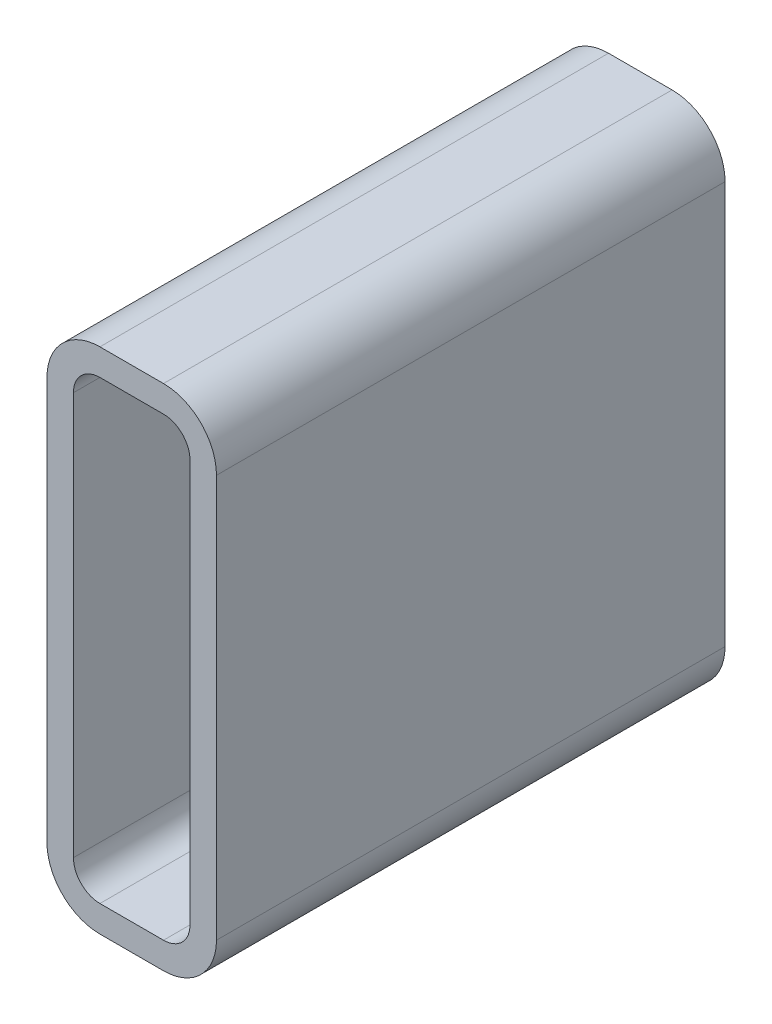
ISO-10303-21;
HEADER;
FILE_DESCRIPTION(('STEP AP214'),'2;1');
FILE_NAME('part.step','',(''),(''),'','','');
FILE_SCHEMA(('AUTOMOTIVE_DESIGN { 1 0 10303 214 1 1 1 1 }'));
ENDSEC;
DATA;
#1=APPLICATION_CONTEXT('core data for automotive mechanical design processes');
#2=APPLICATION_PROTOCOL_DEFINITION('international standard','automotive_design',2000,#1);
#3=PRODUCT_CONTEXT('',#1,'mechanical');
#4=PRODUCT('Part','Part','',(#3));
#5=PRODUCT_RELATED_PRODUCT_CATEGORY('part','',(#4));
#6=PRODUCT_DEFINITION_FORMATION('','',#4);
#7=PRODUCT_DEFINITION_CONTEXT('part definition',#1,'design');
#8=PRODUCT_DEFINITION('design','',#6,#7);
#9=PRODUCT_DEFINITION_SHAPE('','',#8);
#10=(LENGTH_UNIT() NAMED_UNIT(*) SI_UNIT(.MILLI.,.METRE.));
#11=(NAMED_UNIT(*) PLANE_ANGLE_UNIT() SI_UNIT($,.RADIAN.));
#12=(NAMED_UNIT(*) SI_UNIT($,.STERADIAN.) SOLID_ANGLE_UNIT());
#13=UNCERTAINTY_MEASURE_WITH_UNIT(LENGTH_MEASURE(1.E-05),#10,'distance_accuracy_value','');
#14=(GEOMETRIC_REPRESENTATION_CONTEXT(3) GLOBAL_UNCERTAINTY_ASSIGNED_CONTEXT((#13)) GLOBAL_UNIT_ASSIGNED_CONTEXT((#10,
#11,#12)) REPRESENTATION_CONTEXT('',''));
#15=CARTESIAN_POINT('',(0.,0.,0.));
#16=DIRECTION('',(0.,0.,1.));
#17=DIRECTION('',(1.,0.,0.));
#18=AXIS2_PLACEMENT_3D('',#15,#16,#17);
#19=CARTESIAN_POINT('',(33.4251778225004,274.924496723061,304.8));
#20=DIRECTION('',(0.,0.,1.));
#21=DIRECTION('',(1.,0.,0.));
#22=AXIS2_PLACEMENT_3D('',#19,#20,#21);
#23=PLANE('',#22);
#24=CARTESIAN_POINT('',(33.4251778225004,274.924496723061,304.8));
#25=DIRECTION('',(0.,0.,1.));
#26=DIRECTION('',(1.,0.,0.));
#27=AXIS2_PLACEMENT_3D('',#24,#25,#26);
#28=CIRCLE('',#27,31.75);
#29=CARTESIAN_POINT('',(33.4251778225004,306.674496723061,304.8));
#30=VERTEX_POINT('',#29);
#31=CARTESIAN_POINT('',(1.67517782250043,274.924496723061,304.8));
#32=VERTEX_POINT('',#31);
#33=EDGE_CURVE('E211',#30,#32,#28,.T.);
#34=ORIENTED_EDGE('',*,*,#33,.T.);
#35=DIRECTION('',(0.,-1.,0.));
#36=VECTOR('',#35,1.);
#37=CARTESIAN_POINT('',(1.67517782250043,33.6244967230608,304.8));
#38=LINE('',#37,#36);
#39=CARTESIAN_POINT('',(1.67517782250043,33.6244967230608,304.8));
#40=VERTEX_POINT('',#39);
#41=EDGE_CURVE('E214',#32,#40,#38,.T.);
#42=ORIENTED_EDGE('',*,*,#41,.T.);
#43=CARTESIAN_POINT('',(33.4251778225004,33.6244967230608,304.8));
#44=DIRECTION('',(0.,0.,1.));
#45=DIRECTION('',(1.,0.,0.));
#46=AXIS2_PLACEMENT_3D('',#43,#44,#45);
#47=CIRCLE('',#46,31.75);
#48=CARTESIAN_POINT('',(33.4251778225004,1.87449672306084,304.8));
#49=VERTEX_POINT('',#48);
#50=EDGE_CURVE('E217',#40,#49,#47,.T.);
#51=ORIENTED_EDGE('',*,*,#50,.T.);
#52=DIRECTION('',(1.,0.,0.));
#53=VECTOR('',#52,1.);
#54=CARTESIAN_POINT('',(71.5251778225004,1.87449672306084,304.8));
#55=LINE('',#54,#53);
#56=CARTESIAN_POINT('',(71.5251778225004,1.87449672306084,304.8));
#57=VERTEX_POINT('',#56);
#58=EDGE_CURVE('E219',#49,#57,#55,.T.);
#59=ORIENTED_EDGE('',*,*,#58,.T.);
#60=CARTESIAN_POINT('',(71.5251778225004,33.6244967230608,304.8));
#61=DIRECTION('',(0.,0.,1.));
#62=DIRECTION('',(1.,0.,0.));
#63=AXIS2_PLACEMENT_3D('',#60,#61,#62);
#64=CIRCLE('',#63,31.75);
#65=CARTESIAN_POINT('',(103.2751778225,33.6244967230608,304.8));
#66=VERTEX_POINT('',#65);
#67=EDGE_CURVE('E221',#57,#66,#64,.T.);
#68=ORIENTED_EDGE('',*,*,#67,.T.);
#69=DIRECTION('',(0.,1.,0.));
#70=VECTOR('',#69,1.);
#71=CARTESIAN_POINT('',(103.2751778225,274.924496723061,304.8));
#72=LINE('',#71,#70);
#73=CARTESIAN_POINT('',(103.2751778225,274.924496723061,304.8));
#74=VERTEX_POINT('',#73);
#75=EDGE_CURVE('E223',#66,#74,#72,.T.);
#76=ORIENTED_EDGE('',*,*,#75,.T.);
#77=CARTESIAN_POINT('',(71.5251778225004,274.924496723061,304.8));
#78=DIRECTION('',(0.,0.,1.));
#79=DIRECTION('',(1.,0.,0.));
#80=AXIS2_PLACEMENT_3D('',#77,#78,#79);
#81=CIRCLE('',#80,31.75);
#82=CARTESIAN_POINT('',(71.5251778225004,306.674496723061,304.8));
#83=VERTEX_POINT('',#82);
#84=EDGE_CURVE('E225',#74,#83,#81,.T.);
#85=ORIENTED_EDGE('',*,*,#84,.T.);
#86=DIRECTION('',(-1.,0.,0.));
#87=VECTOR('',#86,1.);
#88=CARTESIAN_POINT('',(33.4251778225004,306.674496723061,304.8));
#89=LINE('',#88,#87);
#90=EDGE_CURVE('E227',#83,#30,#89,.T.);
#91=ORIENTED_EDGE('',*,*,#90,.T.);
#92=EDGE_LOOP('',(#34,#42,#51,#59,#68,#76,#85,#91));
#93=FACE_BOUND('',#92,.T.);
#94=DIRECTION('',(0.,-1.,0.));
#95=VECTOR('',#94,1.);
#96=CARTESIAN_POINT('',(17.5501778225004,33.6244967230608,304.8));
#97=LINE('',#96,#95);
#98=CARTESIAN_POINT('',(17.5501778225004,274.924496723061,304.8));
#99=VERTEX_POINT('',#98);
#100=CARTESIAN_POINT('',(17.5501778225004,33.6244967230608,304.8));
#101=VERTEX_POINT('',#100);
#102=EDGE_CURVE('E154',#99,#101,#97,.T.);
#103=ORIENTED_EDGE('',*,*,#102,.F.);
#104=CARTESIAN_POINT('',(33.4251778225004,274.924496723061,304.8));
#105=DIRECTION('',(0.,0.,1.));
#106=DIRECTION('',(1.,0.,0.));
#107=AXIS2_PLACEMENT_3D('',#104,#105,#106);
#108=CIRCLE('',#107,15.875);
#109=CARTESIAN_POINT('',(33.4251778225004,290.799496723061,304.8));
#110=VERTEX_POINT('',#109);
#111=EDGE_CURVE('E146',#110,#99,#108,.T.);
#112=ORIENTED_EDGE('',*,*,#111,.F.);
#113=DIRECTION('',(-1.,0.,0.));
#114=VECTOR('',#113,1.);
#115=CARTESIAN_POINT('',(33.4251778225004,290.799496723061,304.8));
#116=LINE('',#115,#114);
#117=CARTESIAN_POINT('',(71.5251778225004,290.799496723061,304.8));
#118=VERTEX_POINT('',#117);
#119=EDGE_CURVE('E179',#118,#110,#116,.T.);
#120=ORIENTED_EDGE('',*,*,#119,.F.);
#121=CARTESIAN_POINT('',(71.5251778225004,274.924496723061,304.8));
#122=DIRECTION('',(0.,0.,1.));
#123=DIRECTION('',(1.,0.,0.));
#124=AXIS2_PLACEMENT_3D('',#121,#122,#123);
#125=CIRCLE('',#124,15.875);
#126=CARTESIAN_POINT('',(87.4001778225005,274.924496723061,304.8));
#127=VERTEX_POINT('',#126);
#128=EDGE_CURVE('E177',#127,#118,#125,.T.);
#129=ORIENTED_EDGE('',*,*,#128,.F.);
#130=DIRECTION('',(0.,1.,0.));
#131=VECTOR('',#130,1.);
#132=CARTESIAN_POINT('',(87.4001778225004,274.924496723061,304.8));
#133=LINE('',#132,#131);
#134=CARTESIAN_POINT('',(87.4001778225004,33.6244967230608,304.8));
#135=VERTEX_POINT('',#134);
#136=EDGE_CURVE('E175',#135,#127,#133,.T.);
#137=ORIENTED_EDGE('',*,*,#136,.F.);
#138=CARTESIAN_POINT('',(71.5251778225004,33.6244967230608,304.8));
#139=DIRECTION('',(0.,0.,1.));
#140=DIRECTION('',(1.,0.,0.));
#141=AXIS2_PLACEMENT_3D('',#138,#139,#140);
#142=CIRCLE('',#141,15.875);
#143=CARTESIAN_POINT('',(71.5251778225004,17.7494967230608,304.8));
#144=VERTEX_POINT('',#143);
#145=EDGE_CURVE('E173',#144,#135,#142,.T.);
#146=ORIENTED_EDGE('',*,*,#145,.F.);
#147=DIRECTION('',(1.,0.,0.));
#148=VECTOR('',#147,1.);
#149=CARTESIAN_POINT('',(71.5251778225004,17.7494967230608,304.8));
#150=LINE('',#149,#148);
#151=CARTESIAN_POINT('',(33.4251778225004,17.7494967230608,304.8));
#152=VERTEX_POINT('',#151);
#153=EDGE_CURVE('E169',#152,#144,#150,.T.);
#154=ORIENTED_EDGE('',*,*,#153,.F.);
#155=CARTESIAN_POINT('',(33.4251778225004,33.6244967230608,304.8));
#156=DIRECTION('',(0.,0.,1.));
#157=DIRECTION('',(1.,0.,0.));
#158=AXIS2_PLACEMENT_3D('',#155,#156,#157);
#159=CIRCLE('',#158,15.875);
#160=EDGE_CURVE('E167',#101,#152,#159,.T.);
#161=ORIENTED_EDGE('',*,*,#160,.F.);
#162=EDGE_LOOP('',(#103,#112,#120,#129,#137,#146,#154,#161));
#163=FACE_BOUND('',#162,.T.);
#164=ADVANCED_FACE('F33',(#93,#163),#23,.T.);
#165=CARTESIAN_POINT('',(33.4251778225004,274.924496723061,0.));
#166=DIRECTION('',(0.,0.,1.));
#167=DIRECTION('',(1.,0.,0.));
#168=AXIS2_PLACEMENT_3D('',#165,#166,#167);
#169=PLANE('',#168);
#170=CARTESIAN_POINT('',(33.4251778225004,274.924496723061,0.));
#171=DIRECTION('',(0.,0.,1.));
#172=DIRECTION('',(1.,0.,0.));
#173=AXIS2_PLACEMENT_3D('',#170,#171,#172);
#174=CIRCLE('',#173,31.75);
#175=CARTESIAN_POINT('',(33.4251778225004,306.674496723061,0.));
#176=VERTEX_POINT('',#175);
#177=CARTESIAN_POINT('',(1.67517782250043,274.924496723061,0.));
#178=VERTEX_POINT('',#177);
#179=EDGE_CURVE('E162',#176,#178,#174,.T.);
#180=ORIENTED_EDGE('',*,*,#179,.F.);
#181=DIRECTION('',(-1.,0.,0.));
#182=VECTOR('',#181,1.);
#183=CARTESIAN_POINT('',(33.4251778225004,306.674496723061,0.));
#184=LINE('',#183,#182);
#185=CARTESIAN_POINT('',(71.5251778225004,306.674496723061,0.));
#186=VERTEX_POINT('',#185);
#187=EDGE_CURVE('E215',#186,#176,#184,.T.);
#188=ORIENTED_EDGE('',*,*,#187,.F.);
#189=CARTESIAN_POINT('',(71.5251778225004,274.924496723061,0.));
#190=DIRECTION('',(0.,0.,1.));
#191=DIRECTION('',(1.,0.,0.));
#192=AXIS2_PLACEMENT_3D('',#189,#190,#191);
#193=CIRCLE('',#192,31.75);
#194=CARTESIAN_POINT('',(103.2751778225,274.924496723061,0.));
#195=VERTEX_POINT('',#194);
#196=EDGE_CURVE('E242',#195,#186,#193,.T.);
#197=ORIENTED_EDGE('',*,*,#196,.F.);
#198=DIRECTION('',(0.,1.,0.));
#199=VECTOR('',#198,1.);
#200=CARTESIAN_POINT('',(103.2751778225,274.924496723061,0.));
#201=LINE('',#200,#199);
#202=CARTESIAN_POINT('',(103.2751778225,33.6244967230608,0.));
#203=VERTEX_POINT('',#202);
#204=EDGE_CURVE('E240',#203,#195,#201,.T.);
#205=ORIENTED_EDGE('',*,*,#204,.F.);
#206=CARTESIAN_POINT('',(71.5251778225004,33.6244967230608,0.));
#207=DIRECTION('',(0.,0.,1.));
#208=DIRECTION('',(1.,0.,0.));
#209=AXIS2_PLACEMENT_3D('',#206,#207,#208);
#210=CIRCLE('',#209,31.75);
#211=CARTESIAN_POINT('',(71.5251778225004,1.87449672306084,0.));
#212=VERTEX_POINT('',#211);
#213=EDGE_CURVE('E238',#212,#203,#210,.T.);
#214=ORIENTED_EDGE('',*,*,#213,.F.);
#215=DIRECTION('',(1.,0.,0.));
#216=VECTOR('',#215,1.);
#217=CARTESIAN_POINT('',(71.5251778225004,1.87449672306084,0.));
#218=LINE('',#217,#216);
#219=CARTESIAN_POINT('',(33.4251778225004,1.87449672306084,0.));
#220=VERTEX_POINT('',#219);
#221=EDGE_CURVE('E236',#220,#212,#218,.T.);
#222=ORIENTED_EDGE('',*,*,#221,.F.);
#223=CARTESIAN_POINT('',(33.4251778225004,33.6244967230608,0.));
#224=DIRECTION('',(0.,0.,1.));
#225=DIRECTION('',(1.,0.,0.));
#226=AXIS2_PLACEMENT_3D('',#223,#224,#225);
#227=CIRCLE('',#226,31.75);
#228=CARTESIAN_POINT('',(1.67517782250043,33.6244967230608,0.));
#229=VERTEX_POINT('',#228);
#230=EDGE_CURVE('E234',#229,#220,#227,.T.);
#231=ORIENTED_EDGE('',*,*,#230,.F.);
#232=DIRECTION('',(0.,-1.,0.));
#233=VECTOR('',#232,1.);
#234=CARTESIAN_POINT('',(1.67517782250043,33.6244967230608,0.));
#235=LINE('',#234,#233);
#236=EDGE_CURVE('E232',#178,#229,#235,.T.);
#237=ORIENTED_EDGE('',*,*,#236,.F.);
#238=EDGE_LOOP('',(#180,#188,#197,#205,#214,#222,#231,#237));
#239=FACE_BOUND('',#238,.T.);
#240=CARTESIAN_POINT('',(33.4251778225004,274.924496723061,0.));
#241=DIRECTION('',(0.,0.,1.));
#242=DIRECTION('',(1.,0.,0.));
#243=AXIS2_PLACEMENT_3D('',#240,#241,#242);
#244=CIRCLE('',#243,15.875);
#245=CARTESIAN_POINT('',(33.4251778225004,290.799496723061,0.));
#246=VERTEX_POINT('',#245);
#247=CARTESIAN_POINT('',(17.5501778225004,274.924496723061,0.));
#248=VERTEX_POINT('',#247);
#249=EDGE_CURVE('E56',#246,#248,#244,.T.);
#250=ORIENTED_EDGE('',*,*,#249,.T.);
#251=DIRECTION('',(0.,-1.,0.));
#252=VECTOR('',#251,1.);
#253=CARTESIAN_POINT('',(17.5501778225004,33.6244967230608,0.));
#254=LINE('',#253,#252);
#255=CARTESIAN_POINT('',(17.5501778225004,33.6244967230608,0.));
#256=VERTEX_POINT('',#255);
#257=EDGE_CURVE('E161',#248,#256,#254,.T.);
#258=ORIENTED_EDGE('',*,*,#257,.T.);
#259=CARTESIAN_POINT('',(33.4251778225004,33.6244967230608,0.));
#260=DIRECTION('',(0.,0.,1.));
#261=DIRECTION('',(1.,0.,0.));
#262=AXIS2_PLACEMENT_3D('',#259,#260,#261);
#263=CIRCLE('',#262,15.875);
#264=CARTESIAN_POINT('',(33.4251778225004,17.7494967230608,0.));
#265=VERTEX_POINT('',#264);
#266=EDGE_CURVE('E183',#256,#265,#263,.T.);
#267=ORIENTED_EDGE('',*,*,#266,.T.);
#268=DIRECTION('',(1.,0.,0.));
#269=VECTOR('',#268,1.);
#270=CARTESIAN_POINT('',(71.5251778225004,17.7494967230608,0.));
#271=LINE('',#270,#269);
#272=CARTESIAN_POINT('',(71.5251778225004,17.7494967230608,0.));
#273=VERTEX_POINT('',#272);
#274=EDGE_CURVE('E186',#265,#273,#271,.T.);
#275=ORIENTED_EDGE('',*,*,#274,.T.);
#276=CARTESIAN_POINT('',(71.5251778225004,33.6244967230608,0.));
#277=DIRECTION('',(0.,0.,1.));
#278=DIRECTION('',(1.,0.,0.));
#279=AXIS2_PLACEMENT_3D('',#276,#277,#278);
#280=CIRCLE('',#279,15.875);
#281=CARTESIAN_POINT('',(87.4001778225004,33.6244967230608,0.));
#282=VERTEX_POINT('',#281);
#283=EDGE_CURVE('E189',#273,#282,#280,.T.);
#284=ORIENTED_EDGE('',*,*,#283,.T.);
#285=DIRECTION('',(0.,1.,0.));
#286=VECTOR('',#285,1.);
#287=CARTESIAN_POINT('',(87.4001778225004,274.924496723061,0.));
#288=LINE('',#287,#286);
#289=CARTESIAN_POINT('',(87.4001778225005,274.924496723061,0.));
#290=VERTEX_POINT('',#289);
#291=EDGE_CURVE('E192',#282,#290,#288,.T.);
#292=ORIENTED_EDGE('',*,*,#291,.T.);
#293=CARTESIAN_POINT('',(71.5251778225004,274.924496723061,0.));
#294=DIRECTION('',(0.,0.,1.));
#295=DIRECTION('',(1.,0.,0.));
#296=AXIS2_PLACEMENT_3D('',#293,#294,#295);
#297=CIRCLE('',#296,15.875);
#298=CARTESIAN_POINT('',(71.5251778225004,290.799496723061,0.));
#299=VERTEX_POINT('',#298);
#300=EDGE_CURVE('E195',#290,#299,#297,.T.);
#301=ORIENTED_EDGE('',*,*,#300,.T.);
#302=DIRECTION('',(-1.,0.,0.));
#303=VECTOR('',#302,1.);
#304=CARTESIAN_POINT('',(33.4251778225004,290.799496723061,0.));
#305=LINE('',#304,#303);
#306=EDGE_CURVE('E155',#299,#246,#305,.T.);
#307=ORIENTED_EDGE('',*,*,#306,.T.);
#308=EDGE_LOOP('',(#250,#258,#267,#275,#284,#292,#301,#307));
#309=FACE_BOUND('',#308,.T.);
#310=ADVANCED_FACE('F272',(#239,#309),#169,.F.);
#311=CARTESIAN_POINT('',(33.4251778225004,274.924496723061,304.8));
#312=DIRECTION('',(0.,0.,-1.));
#313=DIRECTION('',(-1.,0.,0.));
#314=AXIS2_PLACEMENT_3D('',#311,#312,#313);
#315=CYLINDRICAL_SURFACE('',#314,31.75);
#316=ORIENTED_EDGE('',*,*,#179,.T.);
#317=DIRECTION('',(0.,0.,-1.));
#318=VECTOR('',#317,1.);
#319=CARTESIAN_POINT('',(1.67517782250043,274.924496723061,304.8));
#320=LINE('',#319,#318);
#321=EDGE_CURVE('E11',#32,#178,#320,.T.);
#322=ORIENTED_EDGE('',*,*,#321,.F.);
#323=ORIENTED_EDGE('',*,*,#33,.F.);
#324=DIRECTION('',(0.,0.,-1.));
#325=VECTOR('',#324,1.);
#326=CARTESIAN_POINT('',(33.4251778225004,306.674496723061,304.8));
#327=LINE('',#326,#325);
#328=EDGE_CURVE('E229',#30,#176,#327,.T.);
#329=ORIENTED_EDGE('',*,*,#328,.T.);
#330=EDGE_LOOP('',(#316,#322,#323,#329));
#331=FACE_BOUND('',#330,.T.);
#332=ADVANCED_FACE('F35',(#331),#315,.T.);
#333=CARTESIAN_POINT('',(1.67517782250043,33.6244967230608,304.8));
#334=DIRECTION('',(1.,0.,0.));
#335=DIRECTION('',(0.,0.,-1.));
#336=AXIS2_PLACEMENT_3D('',#333,#334,#335);
#337=PLANE('',#336);
#338=ORIENTED_EDGE('',*,*,#236,.T.);
#339=DIRECTION('',(0.,0.,-1.));
#340=VECTOR('',#339,1.);
#341=CARTESIAN_POINT('',(1.67517782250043,33.6244967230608,304.8));
#342=LINE('',#341,#340);
#343=EDGE_CURVE('E41',#40,#229,#342,.T.);
#344=ORIENTED_EDGE('',*,*,#343,.F.);
#345=ORIENTED_EDGE('',*,*,#41,.F.);
#346=ORIENTED_EDGE('',*,*,#321,.T.);
#347=EDGE_LOOP('',(#338,#344,#345,#346));
#348=FACE_BOUND('',#347,.T.);
#349=ADVANCED_FACE('F289',(#348),#337,.F.);
#350=CARTESIAN_POINT('',(33.4251778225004,33.6244967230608,304.8));
#351=DIRECTION('',(0.,0.,-1.));
#352=DIRECTION('',(-1.,0.,0.));
#353=AXIS2_PLACEMENT_3D('',#350,#351,#352);
#354=CYLINDRICAL_SURFACE('',#353,31.75);
#355=ORIENTED_EDGE('',*,*,#230,.T.);
#356=DIRECTION('',(0.,0.,-1.));
#357=VECTOR('',#356,1.);
#358=CARTESIAN_POINT('',(33.4251778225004,1.87449672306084,304.8));
#359=LINE('',#358,#357);
#360=EDGE_CURVE('E259',#49,#220,#359,.T.);
#361=ORIENTED_EDGE('',*,*,#360,.F.);
#362=ORIENTED_EDGE('',*,*,#50,.F.);
#363=ORIENTED_EDGE('',*,*,#343,.T.);
#364=EDGE_LOOP('',(#355,#361,#362,#363));
#365=FACE_BOUND('',#364,.T.);
#366=ADVANCED_FACE('F266',(#365),#354,.T.);
#367=CARTESIAN_POINT('',(71.5251778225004,1.87449672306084,304.8));
#368=DIRECTION('',(0.,1.,0.));
#369=DIRECTION('',(0.,0.,1.));
#370=AXIS2_PLACEMENT_3D('',#367,#368,#369);
#371=PLANE('',#370);
#372=ORIENTED_EDGE('',*,*,#221,.T.);
#373=DIRECTION('',(0.,0.,-1.));
#374=VECTOR('',#373,1.);
#375=CARTESIAN_POINT('',(71.5251778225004,1.87449672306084,304.8));
#376=LINE('',#375,#374);
#377=EDGE_CURVE('E256',#57,#212,#376,.T.);
#378=ORIENTED_EDGE('',*,*,#377,.F.);
#379=ORIENTED_EDGE('',*,*,#58,.F.);
#380=ORIENTED_EDGE('',*,*,#360,.T.);
#381=EDGE_LOOP('',(#372,#378,#379,#380));
#382=FACE_BOUND('',#381,.T.);
#383=ADVANCED_FACE('F278',(#382),#371,.F.);
#384=CARTESIAN_POINT('',(71.5251778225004,33.6244967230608,304.8));
#385=DIRECTION('',(0.,0.,-1.));
#386=DIRECTION('',(-1.,0.,0.));
#387=AXIS2_PLACEMENT_3D('',#384,#385,#386);
#388=CYLINDRICAL_SURFACE('',#387,31.75);
#389=ORIENTED_EDGE('',*,*,#213,.T.);
#390=DIRECTION('',(0.,0.,-1.));
#391=VECTOR('',#390,1.);
#392=CARTESIAN_POINT('',(103.2751778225,33.6244967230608,304.8));
#393=LINE('',#392,#391);
#394=EDGE_CURVE('E253',#66,#203,#393,.T.);
#395=ORIENTED_EDGE('',*,*,#394,.F.);
#396=ORIENTED_EDGE('',*,*,#67,.F.);
#397=ORIENTED_EDGE('',*,*,#377,.T.);
#398=EDGE_LOOP('',(#389,#395,#396,#397));
#399=FACE_BOUND('',#398,.T.);
#400=ADVANCED_FACE('F282',(#399),#388,.T.);
#401=CARTESIAN_POINT('',(103.2751778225,274.924496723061,304.8));
#402=DIRECTION('',(-1.,0.,0.));
#403=DIRECTION('',(0.,0.,1.));
#404=AXIS2_PLACEMENT_3D('',#401,#402,#403);
#405=PLANE('',#404);
#406=ORIENTED_EDGE('',*,*,#204,.T.);
#407=DIRECTION('',(0.,0.,-1.));
#408=VECTOR('',#407,1.);
#409=CARTESIAN_POINT('',(103.2751778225,274.924496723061,304.8));
#410=LINE('',#409,#408);
#411=EDGE_CURVE('E250',#74,#195,#410,.T.);
#412=ORIENTED_EDGE('',*,*,#411,.F.);
#413=ORIENTED_EDGE('',*,*,#75,.F.);
#414=ORIENTED_EDGE('',*,*,#394,.T.);
#415=EDGE_LOOP('',(#406,#412,#413,#414));
#416=FACE_BOUND('',#415,.T.);
#417=ADVANCED_FACE('F302',(#416),#405,.F.);
#418=CARTESIAN_POINT('',(71.5251778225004,274.924496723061,304.8));
#419=DIRECTION('',(0.,0.,-1.));
#420=DIRECTION('',(-1.,0.,0.));
#421=AXIS2_PLACEMENT_3D('',#418,#419,#420);
#422=CYLINDRICAL_SURFACE('',#421,31.75);
#423=ORIENTED_EDGE('',*,*,#196,.T.);
#424=DIRECTION('',(0.,0.,-1.));
#425=VECTOR('',#424,1.);
#426=CARTESIAN_POINT('',(71.5251778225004,306.674496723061,304.8));
#427=LINE('',#426,#425);
#428=EDGE_CURVE('E247',#83,#186,#427,.T.);
#429=ORIENTED_EDGE('',*,*,#428,.F.);
#430=ORIENTED_EDGE('',*,*,#84,.F.);
#431=ORIENTED_EDGE('',*,*,#411,.T.);
#432=EDGE_LOOP('',(#423,#429,#430,#431));
#433=FACE_BOUND('',#432,.T.);
#434=ADVANCED_FACE('F300',(#433),#422,.T.);
#435=CARTESIAN_POINT('',(33.4251778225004,306.674496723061,304.8));
#436=DIRECTION('',(0.,-1.,0.));
#437=DIRECTION('',(0.,0.,-1.));
#438=AXIS2_PLACEMENT_3D('',#435,#436,#437);
#439=PLANE('',#438);
#440=ORIENTED_EDGE('',*,*,#187,.T.);
#441=ORIENTED_EDGE('',*,*,#328,.F.);
#442=ORIENTED_EDGE('',*,*,#90,.F.);
#443=ORIENTED_EDGE('',*,*,#428,.T.);
#444=EDGE_LOOP('',(#440,#441,#442,#443));
#445=FACE_BOUND('',#444,.T.);
#446=ADVANCED_FACE('F295',(#445),#439,.F.);
#447=CARTESIAN_POINT('',(33.4251778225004,274.924496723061,304.8));
#448=DIRECTION('',(0.,0.,-1.));
#449=DIRECTION('',(-1.,0.,0.));
#450=AXIS2_PLACEMENT_3D('',#447,#448,#449);
#451=CYLINDRICAL_SURFACE('',#450,15.875);
#452=ORIENTED_EDGE('',*,*,#249,.F.);
#453=DIRECTION('',(0.,0.,-1.));
#454=VECTOR('',#453,1.);
#455=CARTESIAN_POINT('',(33.4251778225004,290.799496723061,304.8));
#456=LINE('',#455,#454);
#457=EDGE_CURVE('E150',#110,#246,#456,.T.);
#458=ORIENTED_EDGE('',*,*,#457,.F.);
#459=ORIENTED_EDGE('',*,*,#111,.T.);
#460=DIRECTION('',(0.,0.,-1.));
#461=VECTOR('',#460,1.);
#462=CARTESIAN_POINT('',(17.5501778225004,274.924496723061,304.8));
#463=LINE('',#462,#461);
#464=EDGE_CURVE('E149',#99,#248,#463,.T.);
#465=ORIENTED_EDGE('',*,*,#464,.T.);
#466=EDGE_LOOP('',(#452,#458,#459,#465));
#467=FACE_BOUND('',#466,.T.);
#468=ADVANCED_FACE('F148',(#467),#451,.F.);
#469=CARTESIAN_POINT('',(17.5501778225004,33.6244967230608,304.8));
#470=DIRECTION('',(1.,0.,0.));
#471=DIRECTION('',(0.,0.,-1.));
#472=AXIS2_PLACEMENT_3D('',#469,#470,#471);
#473=PLANE('',#472);
#474=ORIENTED_EDGE('',*,*,#257,.F.);
#475=ORIENTED_EDGE('',*,*,#464,.F.);
#476=ORIENTED_EDGE('',*,*,#102,.T.);
#477=DIRECTION('',(0.,0.,-1.));
#478=VECTOR('',#477,1.);
#479=CARTESIAN_POINT('',(17.5501778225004,33.6244967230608,304.8));
#480=LINE('',#479,#478);
#481=EDGE_CURVE('E163',#101,#256,#480,.T.);
#482=ORIENTED_EDGE('',*,*,#481,.T.);
#483=EDGE_LOOP('',(#474,#475,#476,#482));
#484=FACE_BOUND('',#483,.T.);
#485=ADVANCED_FACE('F158',(#484),#473,.T.);
#486=CARTESIAN_POINT('',(33.4251778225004,33.6244967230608,304.8));
#487=DIRECTION('',(0.,0.,-1.));
#488=DIRECTION('',(-1.,0.,0.));
#489=AXIS2_PLACEMENT_3D('',#486,#487,#488);
#490=CYLINDRICAL_SURFACE('',#489,15.875);
#491=ORIENTED_EDGE('',*,*,#266,.F.);
#492=ORIENTED_EDGE('',*,*,#481,.F.);
#493=ORIENTED_EDGE('',*,*,#160,.T.);
#494=DIRECTION('',(0.,0.,-1.));
#495=VECTOR('',#494,1.);
#496=CARTESIAN_POINT('',(33.4251778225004,17.7494967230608,304.8));
#497=LINE('',#496,#495);
#498=EDGE_CURVE('E208',#152,#265,#497,.T.);
#499=ORIENTED_EDGE('',*,*,#498,.T.);
#500=EDGE_LOOP('',(#491,#492,#493,#499));
#501=FACE_BOUND('',#500,.T.);
#502=ADVANCED_FACE('F327',(#501),#490,.F.);
#503=CARTESIAN_POINT('',(71.5251778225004,17.7494967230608,304.8));
#504=DIRECTION('',(0.,1.,0.));
#505=DIRECTION('',(0.,0.,1.));
#506=AXIS2_PLACEMENT_3D('',#503,#504,#505);
#507=PLANE('',#506);
#508=ORIENTED_EDGE('',*,*,#274,.F.);
#509=ORIENTED_EDGE('',*,*,#498,.F.);
#510=ORIENTED_EDGE('',*,*,#153,.T.);
#511=DIRECTION('',(0.,0.,-1.));
#512=VECTOR('',#511,1.);
#513=CARTESIAN_POINT('',(71.5251778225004,17.7494967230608,304.8));
#514=LINE('',#513,#512);
#515=EDGE_CURVE('E206',#144,#273,#514,.T.);
#516=ORIENTED_EDGE('',*,*,#515,.T.);
#517=EDGE_LOOP('',(#508,#509,#510,#516));
#518=FACE_BOUND('',#517,.T.);
#519=ADVANCED_FACE('F331',(#518),#507,.T.);
#520=CARTESIAN_POINT('',(71.5251778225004,33.6244967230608,304.8));
#521=DIRECTION('',(0.,0.,-1.));
#522=DIRECTION('',(-1.,0.,0.));
#523=AXIS2_PLACEMENT_3D('',#520,#521,#522);
#524=CYLINDRICAL_SURFACE('',#523,15.875);
#525=ORIENTED_EDGE('',*,*,#283,.F.);
#526=ORIENTED_EDGE('',*,*,#515,.F.);
#527=ORIENTED_EDGE('',*,*,#145,.T.);
#528=DIRECTION('',(0.,0.,-1.));
#529=VECTOR('',#528,1.);
#530=CARTESIAN_POINT('',(87.4001778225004,33.6244967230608,304.8));
#531=LINE('',#530,#529);
#532=EDGE_CURVE('E204',#135,#282,#531,.T.);
#533=ORIENTED_EDGE('',*,*,#532,.T.);
#534=EDGE_LOOP('',(#525,#526,#527,#533));
#535=FACE_BOUND('',#534,.T.);
#536=ADVANCED_FACE('F337',(#535),#524,.F.);
#537=CARTESIAN_POINT('',(87.4001778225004,274.924496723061,304.8));
#538=DIRECTION('',(-1.,0.,0.));
#539=DIRECTION('',(0.,0.,1.));
#540=AXIS2_PLACEMENT_3D('',#537,#538,#539);
#541=PLANE('',#540);
#542=ORIENTED_EDGE('',*,*,#291,.F.);
#543=ORIENTED_EDGE('',*,*,#532,.F.);
#544=ORIENTED_EDGE('',*,*,#136,.T.);
#545=DIRECTION('',(0.,0.,-1.));
#546=VECTOR('',#545,1.);
#547=CARTESIAN_POINT('',(87.4001778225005,274.924496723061,304.8));
#548=LINE('',#547,#546);
#549=EDGE_CURVE('E202',#127,#290,#548,.T.);
#550=ORIENTED_EDGE('',*,*,#549,.T.);
#551=EDGE_LOOP('',(#542,#543,#544,#550));
#552=FACE_BOUND('',#551,.T.);
#553=ADVANCED_FACE('F341',(#552),#541,.T.);
#554=CARTESIAN_POINT('',(71.5251778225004,274.924496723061,304.8));
#555=DIRECTION('',(0.,0.,-1.));
#556=DIRECTION('',(-1.,0.,0.));
#557=AXIS2_PLACEMENT_3D('',#554,#555,#556);
#558=CYLINDRICAL_SURFACE('',#557,15.875);
#559=ORIENTED_EDGE('',*,*,#300,.F.);
#560=ORIENTED_EDGE('',*,*,#549,.F.);
#561=ORIENTED_EDGE('',*,*,#128,.T.);
#562=DIRECTION('',(0.,0.,-1.));
#563=VECTOR('',#562,1.);
#564=CARTESIAN_POINT('',(71.5251778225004,290.799496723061,304.8));
#565=LINE('',#564,#563);
#566=EDGE_CURVE('E48',#118,#299,#565,.T.);
#567=ORIENTED_EDGE('',*,*,#566,.T.);
#568=EDGE_LOOP('',(#559,#560,#561,#567));
#569=FACE_BOUND('',#568,.T.);
#570=ADVANCED_FACE('F345',(#569),#558,.F.);
#571=CARTESIAN_POINT('',(33.4251778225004,290.799496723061,304.8));
#572=DIRECTION('',(0.,-1.,0.));
#573=DIRECTION('',(0.,0.,-1.));
#574=AXIS2_PLACEMENT_3D('',#571,#572,#573);
#575=PLANE('',#574);
#576=ORIENTED_EDGE('',*,*,#306,.F.);
#577=ORIENTED_EDGE('',*,*,#566,.F.);
#578=ORIENTED_EDGE('',*,*,#119,.T.);
#579=ORIENTED_EDGE('',*,*,#457,.T.);
#580=EDGE_LOOP('',(#576,#577,#578,#579));
#581=FACE_BOUND('',#580,.T.);
#582=ADVANCED_FACE('F349',(#581),#575,.T.);
#583=CLOSED_SHELL('',(#164,#310,#332,#349,#366,#383,#400,#417,#434,#446,#468,#485,#502,#519,
#536,#553,#570,#582));
#584=MANIFOLD_SOLID_BREP('B2',#583);
#585=ADVANCED_BREP_SHAPE_REPRESENTATION('',(#18,#584),#14);
#586=SHAPE_DEFINITION_REPRESENTATION(#9,#585);
ENDSEC;
END-ISO-10303-21;
